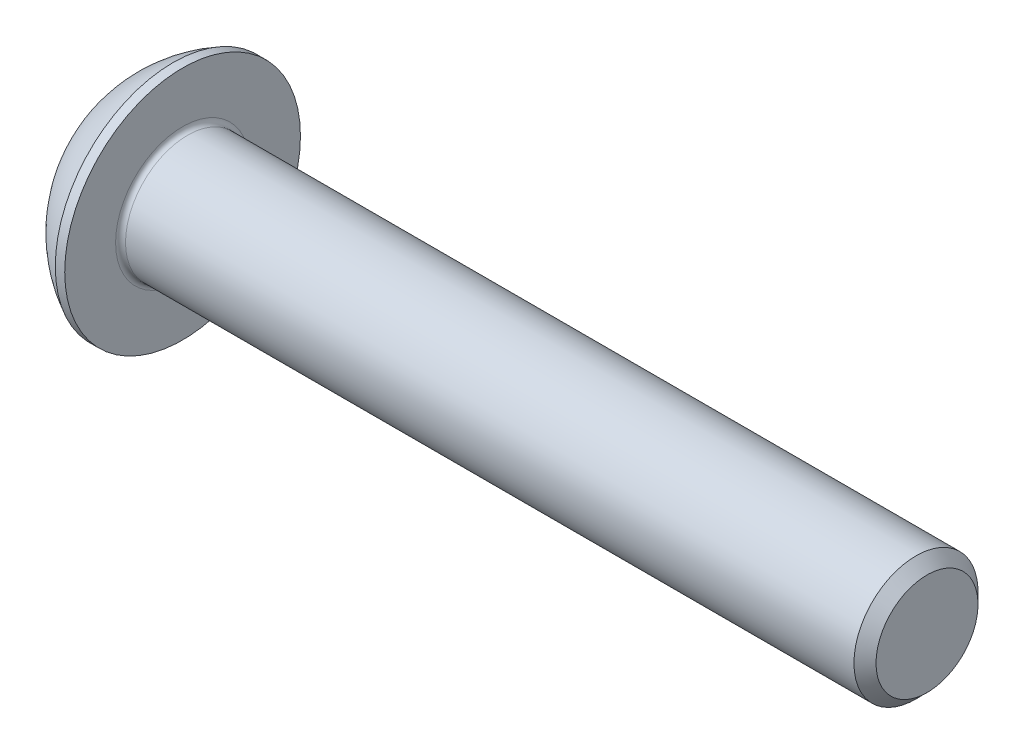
from build123d import *

# Parameters (mm, degrees)
FILLET1_R   = 0.2
HEX_2_DEPTH = 1.56


with BuildPart() as part:
    # BodySke → BaseBody (revolve)
    with BuildSketch(Plane.XY, mode=Mode.PRIVATE) as basebody_sk:
        with BuildLine():
            Line((32.75, 0), (32.75, 2.055))
            Line((32.75, 2.055), (32.305, 2.5))
            Line((32.305, 2.5), (2.75, 2.5))
            Line((2.75, 2.5), (2.75, 4.75))
            Line((2.75, 4.75), (2.37, 4.75))
            ThreePointArc((2.37, 4.75), (0.992680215, 3.754414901), (0, 2.375))
            Line((0, 2.375), (0, 0))
            Line((0, 0), (32.75, 0))
        make_face()
    revolve(basebody_sk.sketch.rotate(Axis((0, 0, 0), (1, 0, 0)), 90), axis=Axis((0, 0, 0), (1, 0, 0)))

    # Fillet1
    fillet1_edges = [part.edges().sort_by_distance(p)[0] for p in [
        (2.75, 0, -2.5),
    ]]
    fillet(fillet1_edges, radius=FILLET1_R)

    # Sketch2 → PreBroach (revolve, cut)
    with BuildSketch(Plane.XY, mode=Mode.PRIVATE) as prebroach_sk:
        Polygon((0, 1.5), (1.56, 1.5), (2.426025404, 0), (0, 0), align=None)
    revolve(prebroach_sk.sketch.rotate(Axis((0, 0, 0), (1, 0, 0)), 90), axis=Axis((0, 0, 0), (1, 0, 0)), mode=Mode.SUBTRACT)

    # Sketch3 → Hex 2 (cut)
    with BuildSketch(Plane(origin=(0, 0, 0), x_dir=(0, 0, -1), z_dir=(1, 0, 0))):
        Polygon((-1.5, -0.866025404), (-1.5, 0.866025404), (0, 1.732050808), (1.5, 0.866025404), (1.5, -0.866025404), (0, -1.732050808), align=None)
    extrude(amount=HEX_2_DEPTH, mode=Mode.SUBTRACT)


solid = part.part
